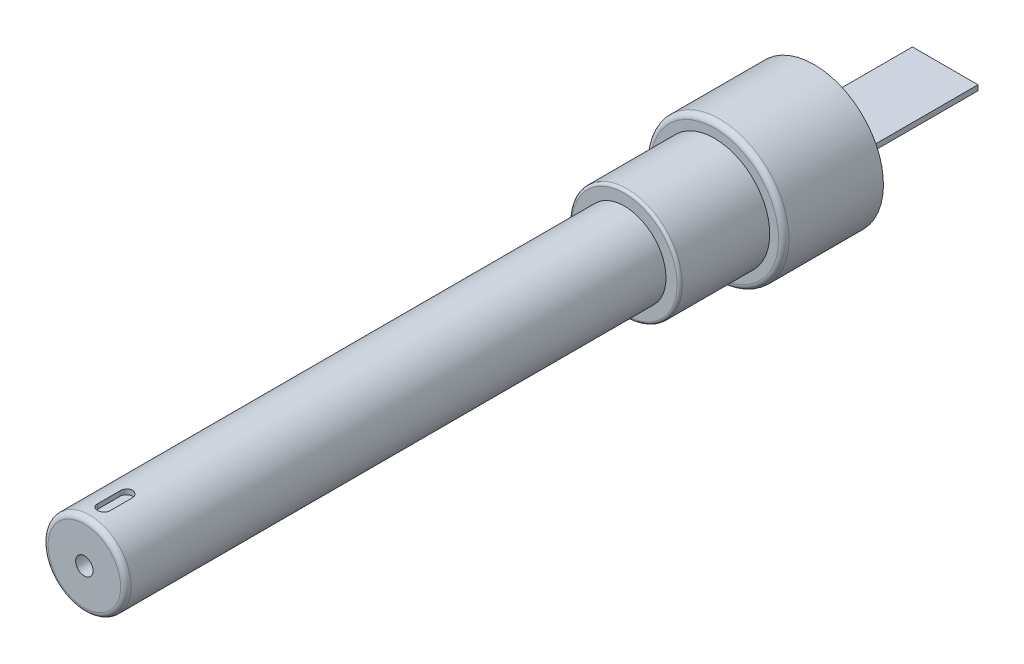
ISO-10303-21;
HEADER;
FILE_DESCRIPTION(('STEP AP214'),'2;1');
FILE_NAME('part.step','',(''),(''),'','','');
FILE_SCHEMA(('AUTOMOTIVE_DESIGN { 1 0 10303 214 1 1 1 1 }'));
ENDSEC;
DATA;
#1=APPLICATION_CONTEXT('core data for automotive mechanical design processes');
#2=APPLICATION_PROTOCOL_DEFINITION('international standard','automotive_design',2000,#1);
#3=PRODUCT_CONTEXT('',#1,'mechanical');
#4=PRODUCT('Part','Part','',(#3));
#5=PRODUCT_RELATED_PRODUCT_CATEGORY('part','',(#4));
#6=PRODUCT_DEFINITION_FORMATION('','',#4);
#7=PRODUCT_DEFINITION_CONTEXT('part definition',#1,'design');
#8=PRODUCT_DEFINITION('design','',#6,#7);
#9=PRODUCT_DEFINITION_SHAPE('','',#8);
#10=(LENGTH_UNIT() NAMED_UNIT(*) SI_UNIT(.MILLI.,.METRE.));
#11=(NAMED_UNIT(*) PLANE_ANGLE_UNIT() SI_UNIT($,.RADIAN.));
#12=(NAMED_UNIT(*) SI_UNIT($,.STERADIAN.) SOLID_ANGLE_UNIT());
#13=UNCERTAINTY_MEASURE_WITH_UNIT(LENGTH_MEASURE(1.E-05),#10,'distance_accuracy_value','');
#14=(GEOMETRIC_REPRESENTATION_CONTEXT(3) GLOBAL_UNCERTAINTY_ASSIGNED_CONTEXT((#13)) GLOBAL_UNIT_ASSIGNED_CONTEXT((#10,
#11,#12)) REPRESENTATION_CONTEXT('',''));
#15=CARTESIAN_POINT('',(0.,0.,0.));
#16=DIRECTION('',(0.,0.,1.));
#17=DIRECTION('',(1.,0.,0.));
#18=AXIS2_PLACEMENT_3D('',#15,#16,#17);
#19=CARTESIAN_POINT('',(0.,8.8011,-99.695));
#20=DIRECTION('',(0.,0.,-1.));
#21=DIRECTION('',(0.,1.,0.));
#22=AXIS2_PLACEMENT_3D('',#19,#20,#21);
#23=PLANE('',#22);
#24=CARTESIAN_POINT('',(0.,0.,-99.695));
#25=DIRECTION('',(0.,0.,-1.));
#26=DIRECTION('',(0.,1.,0.));
#27=AXIS2_PLACEMENT_3D('',#24,#25,#26);
#28=CIRCLE('',#27,8.8011);
#29=CARTESIAN_POINT('',(0.,8.8011,-99.695));
#30=VERTEX_POINT('',#29);
#31=EDGE_CURVE('E153',#30,#30,#28,.T.);
#32=ORIENTED_EDGE('',*,*,#31,.T.);
#33=EDGE_LOOP('',(#32));
#34=FACE_BOUND('',#33,.T.);
#35=DIRECTION('',(-1.,0.,0.));
#36=VECTOR('',#35,1.);
#37=CARTESIAN_POINT('',(4.7625,-0.380999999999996,-99.695));
#38=LINE('',#37,#36);
#39=CARTESIAN_POINT('',(4.7625,-0.380999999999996,-99.695));
#40=VERTEX_POINT('',#39);
#41=CARTESIAN_POINT('',(-4.7625,-0.380999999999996,-99.695));
#42=VERTEX_POINT('',#41);
#43=EDGE_CURVE('E439',#40,#42,#38,.T.);
#44=ORIENTED_EDGE('',*,*,#43,.F.);
#45=DIRECTION('',(0.,-1.,0.));
#46=VECTOR('',#45,1.);
#47=CARTESIAN_POINT('',(4.7625,0.381000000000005,-99.695));
#48=LINE('',#47,#46);
#49=CARTESIAN_POINT('',(4.7625,0.381000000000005,-99.695));
#50=VERTEX_POINT('',#49);
#51=EDGE_CURVE('E126',#50,#40,#48,.T.);
#52=ORIENTED_EDGE('',*,*,#51,.F.);
#53=DIRECTION('',(1.,0.,0.));
#54=VECTOR('',#53,1.);
#55=CARTESIAN_POINT('',(4.7625,0.381000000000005,-99.695));
#56=LINE('',#55,#54);
#57=CARTESIAN_POINT('',(-4.7625,0.381000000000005,-99.695));
#58=VERTEX_POINT('',#57);
#59=EDGE_CURVE('E122',#58,#50,#56,.T.);
#60=ORIENTED_EDGE('',*,*,#59,.F.);
#61=DIRECTION('',(0.,1.,0.));
#62=VECTOR('',#61,1.);
#63=CARTESIAN_POINT('',(-4.7625,0.381000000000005,-99.695));
#64=LINE('',#63,#62);
#65=EDGE_CURVE('E436',#42,#58,#64,.T.);
#66=ORIENTED_EDGE('',*,*,#65,.F.);
#67=EDGE_LOOP('',(#44,#52,#60,#66));
#68=FACE_BOUND('',#67,.T.);
#69=ADVANCED_FACE('F36',(#34,#68),#23,.T.);
#70=CARTESIAN_POINT('',(0.,0.,0.));
#71=DIRECTION('',(0.,0.,1.));
#72=DIRECTION('',(1.,0.,0.));
#73=AXIS2_PLACEMENT_3D('',#70,#71,#72);
#74=CYLINDRICAL_SURFACE('',#73,6.0325);
#75=DIRECTION('',(0.,0.,1.));
#76=VECTOR('',#75,1.);
#77=CARTESIAN_POINT('',(-0.888999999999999,5.96663516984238,0.));
#78=LINE('',#77,#76);
#79=CARTESIAN_POINT('',(-0.889,5.96663516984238,-2.794));
#80=VERTEX_POINT('',#79);
#81=CARTESIAN_POINT('',(-0.889000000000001,5.96663516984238,-6.096));
#82=VERTEX_POINT('',#81);
#83=EDGE_CURVE('E11',#80,#82,#78,.F.);
#84=ORIENTED_EDGE('',*,*,#83,.T.);
#85=CARTESIAN_POINT('',(-0.889000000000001,5.96663516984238,-6.096));
#86=CARTESIAN_POINT('',(-0.889043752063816,5.96661094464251,-6.14572551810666));
#87=CARTESIAN_POINT('',(-0.884830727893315,5.96725612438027,-6.19543217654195));
#88=CARTESIAN_POINT('',(-0.868221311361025,5.96970468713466,-6.29337180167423));
#89=CARTESIAN_POINT('',(-0.855834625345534,5.97150669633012,-6.34160644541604));
#90=CARTESIAN_POINT('',(-0.823202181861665,5.97608973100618,-6.43530329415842));
#91=CARTESIAN_POINT('',(-0.802954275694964,5.97887102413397,-6.48076473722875));
#92=CARTESIAN_POINT('',(-0.755200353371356,5.98509066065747,-6.56764530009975));
#93=CARTESIAN_POINT('',(-0.727694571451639,5.98852898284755,-6.60906455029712));
#94=CARTESIAN_POINT('',(-0.665978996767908,5.99570645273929,-6.68699980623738));
#95=CARTESIAN_POINT('',(-0.631724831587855,5.99944748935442,-6.72348050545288));
#96=CARTESIAN_POINT('',(-0.557577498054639,6.00679192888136,-6.7902017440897));
#97=CARTESIAN_POINT('',(-0.517683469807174,6.01039531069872,-6.82044133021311));
#98=CARTESIAN_POINT('',(-0.433162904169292,6.01707808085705,-6.87394850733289));
#99=CARTESIAN_POINT('',(-0.388515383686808,6.02015497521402,-6.89718329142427));
#100=CARTESIAN_POINT('',(-0.295901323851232,6.02541677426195,-6.93580963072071));
#101=CARTESIAN_POINT('',(-0.247935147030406,6.02760177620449,-6.95120204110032));
#102=CARTESIAN_POINT('',(-0.150410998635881,6.03082040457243,-6.97360045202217));
#103=CARTESIAN_POINT('',(-0.100867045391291,6.03186224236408,-6.98066628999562));
#104=CARTESIAN_POINT('',(-0.00128529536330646,6.03270529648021,-6.986396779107));
#105=CARTESIAN_POINT('',(0.048752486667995,6.03250654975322,-6.98506168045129));
#106=CARTESIAN_POINT('',(0.147490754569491,6.03089735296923,-6.97407519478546));
#107=CARTESIAN_POINT('',(0.196198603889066,6.02949631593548,-6.96448841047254));
#108=CARTESIAN_POINT('',(0.291306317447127,6.0256504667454,-6.93737209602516));
#109=CARTESIAN_POINT('',(0.337706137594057,6.02320563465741,-6.91984241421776));
#110=CARTESIAN_POINT('',(0.42707782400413,6.01753066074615,-6.87727114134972));
#111=CARTESIAN_POINT('',(0.470036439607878,6.01429766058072,-6.85220212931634));
#112=CARTESIAN_POINT('',(0.551159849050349,6.00740700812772,-6.79528477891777));
#113=CARTESIAN_POINT('',(0.589324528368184,6.00374934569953,-6.7634362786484));
#114=CARTESIAN_POINT('',(0.660154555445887,5.99637678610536,-6.6935088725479));
#115=CARTESIAN_POINT('',(0.692765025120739,5.99266167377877,-6.65537438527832));
#116=CARTESIAN_POINT('',(0.751141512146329,5.98562530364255,-6.57413123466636));
#117=CARTESIAN_POINT('',(0.776905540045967,5.98230416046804,-6.53102113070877));
#118=CARTESIAN_POINT('',(0.820864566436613,5.97643137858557,-6.44098828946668));
#119=CARTESIAN_POINT('',(0.839049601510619,5.97388075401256,-6.394060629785));
#120=CARTESIAN_POINT('',(0.86723848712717,5.96985425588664,-6.29780433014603));
#121=CARTESIAN_POINT('',(0.877254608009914,5.96837677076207,-6.24847940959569));
#122=CARTESIAN_POINT('',(0.885031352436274,5.96722528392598,-6.18165777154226));
#123=CARTESIAN_POINT('',(0.886520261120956,5.96700416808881,-6.1645456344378));
#124=CARTESIAN_POINT('',(0.888503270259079,5.96670927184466,-6.1302914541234));
#125=CARTESIAN_POINT('',(0.888999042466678,5.96663524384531,-6.11314950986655));
#126=CARTESIAN_POINT('',(0.889,5.96663516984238,-6.096));
#127=B_SPLINE_CURVE_WITH_KNOTS('',3,(#85,#86,#87,#88,#89,#90,#91,#92,#93,#94,#95,#96,#97,#98,
#99,#100,#101,#102,#103,#104,#105,#106,#107,#108,#109,#110,#111,#112,#113,#114,#115,#116,#117,
#118,#119,#120,#121,#122,#123,#124,#125,#126),.UNSPECIFIED.,.F.,.F.,(4,2,2,2,2,2,2,2,2,2,2,2,2,
2,2,2,2,2,2,2,4),(0.,0.148966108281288,0.297755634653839,0.446585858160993,0.59541127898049,
0.745250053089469,0.895111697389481,1.04566468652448,1.19620125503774,1.34564929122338,
1.49509287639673,1.64337699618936,1.79166394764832,1.94049688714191,2.08933338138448,
2.23956444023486,2.38983910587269,2.54031070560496,2.6905558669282,2.74206874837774,
2.79349484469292),.UNSPECIFIED.);
#128=CARTESIAN_POINT('',(0.888999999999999,5.96663516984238,-6.096));
#129=VERTEX_POINT('',#128);
#130=EDGE_CURVE('E199',#82,#129,#127,.T.);
#131=ORIENTED_EDGE('',*,*,#130,.T.);
#132=DIRECTION('',(0.,0.,1.));
#133=VECTOR('',#132,1.);
#134=CARTESIAN_POINT('',(0.889,5.96663516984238,0.));
#135=LINE('',#134,#133);
#136=CARTESIAN_POINT('',(0.889,5.96663516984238,-2.794));
#137=VERTEX_POINT('',#136);
#138=EDGE_CURVE('E45',#129,#137,#135,.T.);
#139=ORIENTED_EDGE('',*,*,#138,.T.);
#140=CARTESIAN_POINT('',(0.889,5.96663516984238,-2.794));
#141=CARTESIAN_POINT('',(0.889043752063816,5.96661094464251,-2.74427448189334));
#142=CARTESIAN_POINT('',(0.884830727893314,5.96725612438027,-2.69456782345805));
#143=CARTESIAN_POINT('',(0.868221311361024,5.96970468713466,-2.59662819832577));
#144=CARTESIAN_POINT('',(0.855834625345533,5.97150669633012,-2.54839355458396));
#145=CARTESIAN_POINT('',(0.823202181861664,5.97608973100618,-2.45469670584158));
#146=CARTESIAN_POINT('',(0.802954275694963,5.97887102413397,-2.40923526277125));
#147=CARTESIAN_POINT('',(0.755200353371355,5.98509066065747,-2.32235469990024));
#148=CARTESIAN_POINT('',(0.727694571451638,5.98852898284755,-2.28093544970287));
#149=CARTESIAN_POINT('',(0.665978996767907,5.99570645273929,-2.20300019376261));
#150=CARTESIAN_POINT('',(0.631724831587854,5.99944748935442,-2.16651949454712));
#151=CARTESIAN_POINT('',(0.557577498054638,6.00679192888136,-2.0997982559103));
#152=CARTESIAN_POINT('',(0.517683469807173,6.01039531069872,-2.06955866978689));
#153=CARTESIAN_POINT('',(0.433162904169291,6.01707808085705,-2.0160514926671));
#154=CARTESIAN_POINT('',(0.388515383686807,6.02015497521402,-1.99281670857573));
#155=CARTESIAN_POINT('',(0.295901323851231,6.02541677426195,-1.95419036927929));
#156=CARTESIAN_POINT('',(0.247935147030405,6.02760177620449,-1.93879795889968));
#157=CARTESIAN_POINT('',(0.15041099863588,6.03082040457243,-1.91639954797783));
#158=CARTESIAN_POINT('',(0.10086704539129,6.03186224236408,-1.90933371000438));
#159=CARTESIAN_POINT('',(0.0012852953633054,6.03270529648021,-1.903603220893));
#160=CARTESIAN_POINT('',(-0.0487524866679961,6.03250654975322,-1.90493831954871));
#161=CARTESIAN_POINT('',(-0.147490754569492,6.03089735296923,-1.91592480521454));
#162=CARTESIAN_POINT('',(-0.196198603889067,6.02949631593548,-1.92551158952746));
#163=CARTESIAN_POINT('',(-0.291306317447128,6.0256504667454,-1.95262790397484));
#164=CARTESIAN_POINT('',(-0.337706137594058,6.02320563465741,-1.97015758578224));
#165=CARTESIAN_POINT('',(-0.427077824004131,6.01753066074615,-2.01272885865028));
#166=CARTESIAN_POINT('',(-0.470036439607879,6.01429766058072,-2.03779787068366));
#167=CARTESIAN_POINT('',(-0.55115984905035,6.00740700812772,-2.09471522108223));
#168=CARTESIAN_POINT('',(-0.589324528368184,6.00374934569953,-2.1265637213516));
#169=CARTESIAN_POINT('',(-0.660154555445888,5.99637678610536,-2.1964911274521));
#170=CARTESIAN_POINT('',(-0.69276502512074,5.99266167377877,-2.23462561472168));
#171=CARTESIAN_POINT('',(-0.75114151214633,5.98562530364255,-2.31586876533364));
#172=CARTESIAN_POINT('',(-0.776905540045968,5.98230416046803,-2.35897886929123));
#173=CARTESIAN_POINT('',(-0.820864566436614,5.97643137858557,-2.44901171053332));
#174=CARTESIAN_POINT('',(-0.83904960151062,5.97388075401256,-2.495939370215));
#175=CARTESIAN_POINT('',(-0.867238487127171,5.96985425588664,-2.59219566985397));
#176=CARTESIAN_POINT('',(-0.877254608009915,5.96837677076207,-2.64152059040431));
#177=CARTESIAN_POINT('',(-0.885031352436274,5.96722528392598,-2.70834222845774));
#178=CARTESIAN_POINT('',(-0.886520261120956,5.96700416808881,-2.7254543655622));
#179=CARTESIAN_POINT('',(-0.888503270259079,5.96670927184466,-2.7597085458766));
#180=CARTESIAN_POINT('',(-0.888999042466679,5.96663524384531,-2.77685049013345));
#181=CARTESIAN_POINT('',(-0.889,5.96663516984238,-2.794));
#182=B_SPLINE_CURVE_WITH_KNOTS('',3,(#140,#141,#142,#143,#144,#145,#146,#147,#148,#149,#150,
#151,#152,#153,#154,#155,#156,#157,#158,#159,#160,#161,#162,#163,#164,#165,#166,#167,#168,#169,
#170,#171,#172,#173,#174,#175,#176,#177,#178,#179,#180,#181),.UNSPECIFIED.,.F.,.F.,(4,2,2,2,2,2,
2,2,2,2,2,2,2,2,2,2,2,2,2,2,4),(0.,0.148966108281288,0.297755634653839,0.446585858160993,
0.595411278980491,0.745250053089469,0.895111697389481,1.04566468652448,1.19620125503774,
1.34564929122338,1.49509287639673,1.64337699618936,1.79166394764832,1.94049688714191,
2.08933338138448,2.23956444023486,2.38983910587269,2.54031070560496,2.6905558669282,
2.74206874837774,2.79349484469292),.UNSPECIFIED.);
#183=EDGE_CURVE('E60',#137,#80,#182,.T.);
#184=ORIENTED_EDGE('',*,*,#183,.T.);
#185=EDGE_LOOP('',(#84,#131,#139,#184));
#186=FACE_BOUND('',#185,.T.);
#187=CARTESIAN_POINT('',(0.,0.,-0.762000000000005));
#188=DIRECTION('',(0.,0.,1.));
#189=DIRECTION('',(1.,0.,0.));
#190=AXIS2_PLACEMENT_3D('',#187,#188,#189);
#191=CIRCLE('',#190,6.0325);
#192=CARTESIAN_POINT('',(6.0325,0.,-0.762000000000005));
#193=VERTEX_POINT('',#192);
#194=EDGE_CURVE('E196',#193,#193,#191,.T.);
#195=ORIENTED_EDGE('',*,*,#194,.F.);
#196=EDGE_LOOP('',(#195));
#197=FACE_BOUND('',#196,.T.);
#198=CARTESIAN_POINT('',(0.,0.,-78.486));
#199=DIRECTION('',(0.,0.,1.));
#200=DIRECTION('',(0.,-1.,0.));
#201=AXIS2_PLACEMENT_3D('',#198,#199,#200);
#202=CIRCLE('',#201,6.0325);
#203=CARTESIAN_POINT('',(0.,-6.0325,-78.486));
#204=VERTEX_POINT('',#203);
#205=EDGE_CURVE('E156',#204,#204,#202,.T.);
#206=ORIENTED_EDGE('',*,*,#205,.T.);
#207=EDGE_LOOP('',(#206));
#208=FACE_BOUND('',#207,.T.);
#209=ADVANCED_FACE('F38',(#186,#197,#208),#74,.T.);
#210=CARTESIAN_POINT('',(0.,0.,-0.762));
#211=DIRECTION('',(0.,0.,1.));
#212=DIRECTION('',(1.,0.,0.));
#213=AXIS2_PLACEMENT_3D('',#210,#211,#212);
#214=TOROIDAL_SURFACE('',#213,5.2705,0.762);
#215=CARTESIAN_POINT('',(0.,0.,0.));
#216=DIRECTION('',(0.,0.,1.));
#217=DIRECTION('',(1.,0.,0.));
#218=AXIS2_PLACEMENT_3D('',#215,#216,#217);
#219=CIRCLE('',#218,5.27049999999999);
#220=CARTESIAN_POINT('',(5.27049999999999,0.,0.));
#221=VERTEX_POINT('',#220);
#222=EDGE_CURVE('E193',#221,#221,#219,.T.);
#223=ORIENTED_EDGE('',*,*,#222,.F.);
#224=EDGE_LOOP('',(#223));
#225=FACE_BOUND('',#224,.T.);
#226=ORIENTED_EDGE('',*,*,#194,.T.);
#227=EDGE_LOOP('',(#226));
#228=FACE_BOUND('',#227,.T.);
#229=ADVANCED_FACE('F242',(#225,#228),#214,.T.);
#230=CARTESIAN_POINT('',(0.,1.27,0.));
#231=DIRECTION('',(0.,0.,-1.));
#232=DIRECTION('',(-1.,0.,0.));
#233=AXIS2_PLACEMENT_3D('',#230,#231,#232);
#234=PLANE('',#233);
#235=CARTESIAN_POINT('',(0.,0.,0.));
#236=DIRECTION('',(0.,0.,1.));
#237=DIRECTION('',(1.,0.,0.));
#238=AXIS2_PLACEMENT_3D('',#235,#236,#237);
#239=CIRCLE('',#238,1.27);
#240=CARTESIAN_POINT('',(1.27,0.,0.));
#241=VERTEX_POINT('',#240);
#242=EDGE_CURVE('E190',#241,#241,#239,.T.);
#243=ORIENTED_EDGE('',*,*,#242,.F.);
#244=EDGE_LOOP('',(#243));
#245=FACE_BOUND('',#244,.T.);
#246=ORIENTED_EDGE('',*,*,#222,.T.);
#247=EDGE_LOOP('',(#246));
#248=FACE_BOUND('',#247,.T.);
#249=ADVANCED_FACE('F239',(#245,#248),#234,.F.);
#250=CARTESIAN_POINT('',(0.,0.,0.));
#251=DIRECTION('',(0.,0.,1.));
#252=DIRECTION('',(1.,0.,0.));
#253=AXIS2_PLACEMENT_3D('',#250,#251,#252);
#254=CYLINDRICAL_SURFACE('',#253,1.27);
#255=CARTESIAN_POINT('',(0.,0.,-9.525));
#256=DIRECTION('',(0.,0.,1.));
#257=DIRECTION('',(1.,0.,0.));
#258=AXIS2_PLACEMENT_3D('',#255,#256,#257);
#259=CIRCLE('',#258,1.27);
#260=CARTESIAN_POINT('',(1.27,0.,-9.525));
#261=VERTEX_POINT('',#260);
#262=EDGE_CURVE('E187',#261,#261,#259,.T.);
#263=ORIENTED_EDGE('',*,*,#262,.F.);
#264=EDGE_LOOP('',(#263));
#265=FACE_BOUND('',#264,.T.);
#266=ORIENTED_EDGE('',*,*,#242,.T.);
#267=EDGE_LOOP('',(#266));
#268=FACE_BOUND('',#267,.T.);
#269=ADVANCED_FACE('F235',(#265,#268),#254,.F.);
#270=CARTESIAN_POINT('',(0.,5.5245,-9.525));
#271=DIRECTION('',(0.,0.,1.));
#272=DIRECTION('',(1.,0.,0.));
#273=AXIS2_PLACEMENT_3D('',#270,#271,#272);
#274=PLANE('',#273);
#275=CARTESIAN_POINT('',(0.,0.,-9.525));
#276=DIRECTION('',(0.,0.,1.));
#277=DIRECTION('',(1.,0.,0.));
#278=AXIS2_PLACEMENT_3D('',#275,#276,#277);
#279=CIRCLE('',#278,5.5245);
#280=CARTESIAN_POINT('',(5.5245,0.,-9.525));
#281=VERTEX_POINT('',#280);
#282=EDGE_CURVE('E184',#281,#281,#279,.T.);
#283=ORIENTED_EDGE('',*,*,#282,.F.);
#284=EDGE_LOOP('',(#283));
#285=FACE_BOUND('',#284,.T.);
#286=ORIENTED_EDGE('',*,*,#262,.T.);
#287=EDGE_LOOP('',(#286));
#288=FACE_BOUND('',#287,.T.);
#289=ADVANCED_FACE('F231',(#285,#288),#274,.F.);
#290=CARTESIAN_POINT('',(0.,0.,0.));
#291=DIRECTION('',(0.,0.,1.));
#292=DIRECTION('',(1.,0.,0.));
#293=AXIS2_PLACEMENT_3D('',#290,#291,#292);
#294=CYLINDRICAL_SURFACE('',#293,5.5245);
#295=CARTESIAN_POINT('',(0.,0.,-78.486));
#296=DIRECTION('',(0.,0.,1.));
#297=DIRECTION('',(1.,0.,0.));
#298=AXIS2_PLACEMENT_3D('',#295,#296,#297);
#299=CIRCLE('',#298,5.5245);
#300=CARTESIAN_POINT('',(5.5245,0.,-78.486));
#301=VERTEX_POINT('',#300);
#302=EDGE_CURVE('E174',#301,#301,#299,.T.);
#303=ORIENTED_EDGE('',*,*,#302,.F.);
#304=EDGE_LOOP('',(#303));
#305=FACE_BOUND('',#304,.T.);
#306=ORIENTED_EDGE('',*,*,#282,.T.);
#307=EDGE_LOOP('',(#306));
#308=FACE_BOUND('',#307,.T.);
#309=ADVANCED_FACE('F228',(#305,#308),#294,.F.);
#310=CARTESIAN_POINT('',(0.,5.2705,-2.794));
#311=DIRECTION('',(0.,1.,0.));
#312=DIRECTION('',(0.,0.,1.));
#313=AXIS2_PLACEMENT_3D('',#310,#311,#312);
#314=CYLINDRICAL_SURFACE('',#313,0.889);
#315=DIRECTION('',(0.,1.,0.));
#316=VECTOR('',#315,1.);
#317=CARTESIAN_POINT('',(0.889,5.2705,-2.794));
#318=LINE('',#317,#316);
#319=CARTESIAN_POINT('',(0.889,5.2705,-2.794));
#320=VERTEX_POINT('',#319);
#321=EDGE_CURVE('E171',#320,#137,#318,.T.);
#322=ORIENTED_EDGE('',*,*,#321,.F.);
#323=CARTESIAN_POINT('',(0.,5.2705,-2.794));
#324=DIRECTION('',(0.,1.,0.));
#325=DIRECTION('',(0.,0.,1.));
#326=AXIS2_PLACEMENT_3D('',#323,#324,#325);
#327=CIRCLE('',#326,0.889);
#328=CARTESIAN_POINT('',(-0.889,5.2705,-2.794));
#329=VERTEX_POINT('',#328);
#330=EDGE_CURVE('E159',#329,#320,#327,.T.);
#331=ORIENTED_EDGE('',*,*,#330,.F.);
#332=DIRECTION('',(0.,1.,0.));
#333=VECTOR('',#332,1.);
#334=CARTESIAN_POINT('',(-0.889,5.2705,-2.794));
#335=LINE('',#334,#333);
#336=EDGE_CURVE('E172',#329,#80,#335,.T.);
#337=ORIENTED_EDGE('',*,*,#336,.T.);
#338=ORIENTED_EDGE('',*,*,#183,.F.);
#339=EDGE_LOOP('',(#322,#331,#337,#338));
#340=FACE_BOUND('',#339,.T.);
#341=ADVANCED_FACE('F224',(#340),#314,.F.);
#342=CARTESIAN_POINT('',(-0.889,5.2705,-2.794));
#343=DIRECTION('',(-1.,0.,0.));
#344=DIRECTION('',(0.,0.,1.));
#345=AXIS2_PLACEMENT_3D('',#342,#343,#344);
#346=PLANE('',#345);
#347=ORIENTED_EDGE('',*,*,#336,.F.);
#348=DIRECTION('',(0.,0.,1.));
#349=VECTOR('',#348,1.);
#350=CARTESIAN_POINT('',(-0.889,5.2705,-2.794));
#351=LINE('',#350,#349);
#352=CARTESIAN_POINT('',(-0.889000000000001,5.2705,-6.096));
#353=VERTEX_POINT('',#352);
#354=EDGE_CURVE('E168',#353,#329,#351,.T.);
#355=ORIENTED_EDGE('',*,*,#354,.F.);
#356=DIRECTION('',(0.,1.,0.));
#357=VECTOR('',#356,1.);
#358=CARTESIAN_POINT('',(-0.889000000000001,5.2705,-6.096));
#359=LINE('',#358,#357);
#360=EDGE_CURVE('E175',#353,#82,#359,.T.);
#361=ORIENTED_EDGE('',*,*,#360,.T.);
#362=ORIENTED_EDGE('',*,*,#83,.F.);
#363=EDGE_LOOP('',(#347,#355,#361,#362));
#364=FACE_BOUND('',#363,.T.);
#365=ADVANCED_FACE('F218',(#364),#346,.F.);
#366=CARTESIAN_POINT('',(0.,5.2705,-6.096));
#367=DIRECTION('',(0.,1.,0.));
#368=DIRECTION('',(0.,0.,1.));
#369=AXIS2_PLACEMENT_3D('',#366,#367,#368);
#370=CYLINDRICAL_SURFACE('',#369,0.889);
#371=ORIENTED_EDGE('',*,*,#360,.F.);
#372=CARTESIAN_POINT('',(0.,5.2705,-6.096));
#373=DIRECTION('',(0.,1.,0.));
#374=DIRECTION('',(0.,0.,1.));
#375=AXIS2_PLACEMENT_3D('',#372,#373,#374);
#376=CIRCLE('',#375,0.889);
#377=CARTESIAN_POINT('',(0.888999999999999,5.2705,-6.096));
#378=VERTEX_POINT('',#377);
#379=EDGE_CURVE('E165',#378,#353,#376,.T.);
#380=ORIENTED_EDGE('',*,*,#379,.F.);
#381=DIRECTION('',(0.,1.,0.));
#382=VECTOR('',#381,1.);
#383=CARTESIAN_POINT('',(0.888999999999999,5.2705,-6.096));
#384=LINE('',#383,#382);
#385=EDGE_CURVE('E178',#378,#129,#384,.T.);
#386=ORIENTED_EDGE('',*,*,#385,.T.);
#387=ORIENTED_EDGE('',*,*,#130,.F.);
#388=EDGE_LOOP('',(#371,#380,#386,#387));
#389=FACE_BOUND('',#388,.T.);
#390=ADVANCED_FACE('F212',(#389),#370,.F.);
#391=CARTESIAN_POINT('',(0.889,5.2705,-2.794));
#392=DIRECTION('',(1.,0.,0.));
#393=DIRECTION('',(0.,0.,-1.));
#394=AXIS2_PLACEMENT_3D('',#391,#392,#393);
#395=PLANE('',#394);
#396=ORIENTED_EDGE('',*,*,#385,.F.);
#397=DIRECTION('',(0.,0.,-1.));
#398=VECTOR('',#397,1.);
#399=CARTESIAN_POINT('',(0.889,5.2705,-2.794));
#400=LINE('',#399,#398);
#401=EDGE_CURVE('E162',#320,#378,#400,.T.);
#402=ORIENTED_EDGE('',*,*,#401,.F.);
#403=ORIENTED_EDGE('',*,*,#321,.T.);
#404=ORIENTED_EDGE('',*,*,#138,.F.);
#405=EDGE_LOOP('',(#396,#402,#403,#404));
#406=FACE_BOUND('',#405,.T.);
#407=ADVANCED_FACE('F217',(#406),#395,.F.);
#408=CARTESIAN_POINT('',(0.,5.2705,-2.794));
#409=DIRECTION('',(0.,1.,0.));
#410=DIRECTION('',(0.,0.,1.));
#411=AXIS2_PLACEMENT_3D('',#408,#409,#410);
#412=PLANE('',#411);
#413=ORIENTED_EDGE('',*,*,#330,.T.);
#414=ORIENTED_EDGE('',*,*,#401,.T.);
#415=ORIENTED_EDGE('',*,*,#379,.T.);
#416=ORIENTED_EDGE('',*,*,#354,.T.);
#417=EDGE_LOOP('',(#413,#414,#415,#416));
#418=FACE_BOUND('',#417,.T.);
#419=ADVANCED_FACE('F222',(#418),#412,.T.);
#420=CARTESIAN_POINT('',(0.,0.,-78.486));
#421=DIRECTION('',(0.,0.,1.));
#422=DIRECTION('',(0.,-1.,0.));
#423=AXIS2_PLACEMENT_3D('',#420,#421,#422);
#424=PLANE('',#423);
#425=ORIENTED_EDGE('',*,*,#302,.T.);
#426=EDGE_LOOP('',(#425));
#427=FACE_BOUND('',#426,.T.);
#428=ADVANCED_FACE('F264',(#427),#424,.T.);
#429=CARTESIAN_POINT('',(0.,0.,-78.486));
#430=DIRECTION('',(0.,0.,-1.));
#431=DIRECTION('',(0.,1.,0.));
#432=AXIS2_PLACEMENT_3D('',#429,#430,#431);
#433=CIRCLE('',#432,7.6454);
#434=CARTESIAN_POINT('',(0.,7.6454,-78.486));
#435=VERTEX_POINT('',#434);
#436=EDGE_CURVE('E128',#435,#435,#433,.T.);
#437=ORIENTED_EDGE('',*,*,#436,.F.);
#438=EDGE_LOOP('',(#437));
#439=FACE_BOUND('',#438,.T.);
#440=ORIENTED_EDGE('',*,*,#205,.F.);
#441=EDGE_LOOP('',(#440));
#442=FACE_BOUND('',#441,.T.);
#443=ADVANCED_FACE('F262',(#439,#442),#424,.T.);
#444=CARTESIAN_POINT('',(0.,0.,-116.808391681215));
#445=DIRECTION('',(0.,0.,-1.));
#446=DIRECTION('',(0.,1.,0.));
#447=AXIS2_PLACEMENT_3D('',#444,#445,#446);
#448=CYLINDRICAL_SURFACE('',#447,8.8011);
#449=CARTESIAN_POINT('',(0.,0.,-106.045));
#450=DIRECTION('',(0.,0.,-1.));
#451=DIRECTION('',(0.,1.,0.));
#452=AXIS2_PLACEMENT_3D('',#449,#450,#451);
#453=CIRCLE('',#452,8.8011);
#454=CARTESIAN_POINT('',(0.,8.8011,-106.045));
#455=VERTEX_POINT('',#454);
#456=EDGE_CURVE('E150',#455,#455,#453,.T.);
#457=ORIENTED_EDGE('',*,*,#456,.T.);
#458=EDGE_LOOP('',(#457));
#459=FACE_BOUND('',#458,.T.);
#460=ORIENTED_EDGE('',*,*,#31,.F.);
#461=EDGE_LOOP('',(#460));
#462=FACE_BOUND('',#461,.T.);
#463=ADVANCED_FACE('F260',(#459,#462),#448,.F.);
#464=CARTESIAN_POINT('',(0.,10.0711,-106.045));
#465=DIRECTION('',(0.,0.,-1.));
#466=DIRECTION('',(0.,1.,0.));
#467=AXIS2_PLACEMENT_3D('',#464,#465,#466);
#468=PLANE('',#467);
#469=CARTESIAN_POINT('',(0.,0.,-106.045));
#470=DIRECTION('',(0.,0.,-1.));
#471=DIRECTION('',(0.,1.,0.));
#472=AXIS2_PLACEMENT_3D('',#469,#470,#471);
#473=CIRCLE('',#472,10.0711);
#474=CARTESIAN_POINT('',(0.,10.0711,-106.045));
#475=VERTEX_POINT('',#474);
#476=EDGE_CURVE('E147',#475,#475,#473,.T.);
#477=ORIENTED_EDGE('',*,*,#476,.T.);
#478=EDGE_LOOP('',(#477));
#479=FACE_BOUND('',#478,.T.);
#480=ORIENTED_EDGE('',*,*,#456,.F.);
#481=EDGE_LOOP('',(#480));
#482=FACE_BOUND('',#481,.T.);
#483=ADVANCED_FACE('F324',(#479,#482),#468,.T.);
#484=CARTESIAN_POINT('',(0.,0.,-116.808391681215));
#485=DIRECTION('',(0.,0.,-1.));
#486=DIRECTION('',(0.,1.,0.));
#487=AXIS2_PLACEMENT_3D('',#484,#485,#486);
#488=CYLINDRICAL_SURFACE('',#487,10.0711);
#489=CARTESIAN_POINT('',(0.,0.,-92.329));
#490=DIRECTION('',(0.,0.,-1.));
#491=DIRECTION('',(0.,1.,0.));
#492=AXIS2_PLACEMENT_3D('',#489,#490,#491);
#493=CIRCLE('',#492,10.0711);
#494=CARTESIAN_POINT('',(0.,10.0711,-92.329));
#495=VERTEX_POINT('',#494);
#496=EDGE_CURVE('E144',#495,#495,#493,.T.);
#497=ORIENTED_EDGE('',*,*,#496,.T.);
#498=EDGE_LOOP('',(#497));
#499=FACE_BOUND('',#498,.T.);
#500=ORIENTED_EDGE('',*,*,#476,.F.);
#501=EDGE_LOOP('',(#500));
#502=FACE_BOUND('',#501,.T.);
#503=ADVANCED_FACE('F333',(#499,#502),#488,.T.);
#504=CARTESIAN_POINT('',(0.,0.,-92.329));
#505=DIRECTION('',(0.,0.,-1.));
#506=DIRECTION('',(0.,1.,0.));
#507=AXIS2_PLACEMENT_3D('',#504,#505,#506);
#508=TOROIDAL_SURFACE('',#507,9.3091,0.762);
#509=CARTESIAN_POINT('',(0.,0.,-91.567));
#510=DIRECTION('',(0.,0.,-1.));
#511=DIRECTION('',(0.,1.,0.));
#512=AXIS2_PLACEMENT_3D('',#509,#510,#511);
#513=CIRCLE('',#512,9.3091);
#514=CARTESIAN_POINT('',(0.,9.3091,-91.567));
#515=VERTEX_POINT('',#514);
#516=EDGE_CURVE('E141',#515,#515,#513,.T.);
#517=ORIENTED_EDGE('',*,*,#516,.T.);
#518=EDGE_LOOP('',(#517));
#519=FACE_BOUND('',#518,.T.);
#520=ORIENTED_EDGE('',*,*,#496,.F.);
#521=EDGE_LOOP('',(#520));
#522=FACE_BOUND('',#521,.T.);
#523=ADVANCED_FACE('F342',(#519,#522),#508,.T.);
#524=CARTESIAN_POINT('',(0.,8.0264,-91.567));
#525=DIRECTION('',(0.,0.,1.));
#526=DIRECTION('',(0.,-1.,0.));
#527=AXIS2_PLACEMENT_3D('',#524,#525,#526);
#528=PLANE('',#527);
#529=CARTESIAN_POINT('',(0.,0.,-91.567));
#530=DIRECTION('',(0.,0.,-1.));
#531=DIRECTION('',(0.,1.,0.));
#532=AXIS2_PLACEMENT_3D('',#529,#530,#531);
#533=CIRCLE('',#532,8.0264);
#534=CARTESIAN_POINT('',(0.,8.0264,-91.567));
#535=VERTEX_POINT('',#534);
#536=EDGE_CURVE('E138',#535,#535,#533,.T.);
#537=ORIENTED_EDGE('',*,*,#536,.T.);
#538=EDGE_LOOP('',(#537));
#539=FACE_BOUND('',#538,.T.);
#540=ORIENTED_EDGE('',*,*,#516,.F.);
#541=EDGE_LOOP('',(#540));
#542=FACE_BOUND('',#541,.T.);
#543=ADVANCED_FACE('F352',(#539,#542),#528,.T.);
#544=CARTESIAN_POINT('',(0.,0.,-116.808391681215));
#545=DIRECTION('',(0.,0.,-1.));
#546=DIRECTION('',(0.,1.,0.));
#547=AXIS2_PLACEMENT_3D('',#544,#545,#546);
#548=CYLINDRICAL_SURFACE('',#547,8.0264);
#549=CARTESIAN_POINT('',(0.,0.,-78.867));
#550=DIRECTION('',(0.,0.,-1.));
#551=DIRECTION('',(0.,1.,0.));
#552=AXIS2_PLACEMENT_3D('',#549,#550,#551);
#553=CIRCLE('',#552,8.0264);
#554=CARTESIAN_POINT('',(0.,8.0264,-78.867));
#555=VERTEX_POINT('',#554);
#556=EDGE_CURVE('E131',#555,#555,#553,.T.);
#557=ORIENTED_EDGE('',*,*,#556,.T.);
#558=EDGE_LOOP('',(#557));
#559=FACE_BOUND('',#558,.T.);
#560=ORIENTED_EDGE('',*,*,#536,.F.);
#561=EDGE_LOOP('',(#560));
#562=FACE_BOUND('',#561,.T.);
#563=ADVANCED_FACE('F362',(#559,#562),#548,.T.);
#564=CARTESIAN_POINT('',(0.,0.,-78.867));
#565=DIRECTION('',(0.,0.,-1.));
#566=DIRECTION('',(0.,1.,0.));
#567=AXIS2_PLACEMENT_3D('',#564,#565,#566);
#568=TOROIDAL_SURFACE('',#567,7.6454,0.381000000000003);
#569=ORIENTED_EDGE('',*,*,#436,.T.);
#570=EDGE_LOOP('',(#569));
#571=FACE_BOUND('',#570,.T.);
#572=ORIENTED_EDGE('',*,*,#556,.F.);
#573=EDGE_LOOP('',(#572));
#574=FACE_BOUND('',#573,.T.);
#575=ADVANCED_FACE('F372',(#571,#574),#568,.T.);
#576=CARTESIAN_POINT('',(4.7625,0.381000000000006,-125.095));
#577=DIRECTION('',(-1.,0.,0.));
#578=DIRECTION('',(0.,0.,1.));
#579=AXIS2_PLACEMENT_3D('',#576,#577,#578);
#580=PLANE('',#579);
#581=ORIENTED_EDGE('',*,*,#51,.T.);
#582=DIRECTION('',(0.,0.,1.));
#583=VECTOR('',#582,1.);
#584=CARTESIAN_POINT('',(4.7625,-0.380999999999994,-125.095));
#585=LINE('',#584,#583);
#586=CARTESIAN_POINT('',(4.7625,-0.380999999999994,-125.095));
#587=VERTEX_POINT('',#586);
#588=EDGE_CURVE('E107',#587,#40,#585,.T.);
#589=ORIENTED_EDGE('',*,*,#588,.F.);
#590=DIRECTION('',(0.,-1.,0.));
#591=VECTOR('',#590,1.);
#592=CARTESIAN_POINT('',(4.7625,0.381000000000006,-125.095));
#593=LINE('',#592,#591);
#594=CARTESIAN_POINT('',(4.7625,0.381000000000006,-125.095));
#595=VERTEX_POINT('',#594);
#596=EDGE_CURVE('E114',#595,#587,#593,.T.);
#597=ORIENTED_EDGE('',*,*,#596,.F.);
#598=DIRECTION('',(0.,0.,1.));
#599=VECTOR('',#598,1.);
#600=CARTESIAN_POINT('',(4.7625,0.381000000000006,-125.095));
#601=LINE('',#600,#599);
#602=EDGE_CURVE('E434',#595,#50,#601,.T.);
#603=ORIENTED_EDGE('',*,*,#602,.T.);
#604=EDGE_LOOP('',(#581,#589,#597,#603));
#605=FACE_BOUND('',#604,.T.);
#606=ADVANCED_FACE('F124',(#605),#580,.F.);
#607=CARTESIAN_POINT('',(4.7625,-0.380999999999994,-125.095));
#608=DIRECTION('',(0.,1.,0.));
#609=DIRECTION('',(0.,0.,1.));
#610=AXIS2_PLACEMENT_3D('',#607,#608,#609);
#611=PLANE('',#610);
#612=ORIENTED_EDGE('',*,*,#43,.T.);
#613=DIRECTION('',(0.,0.,1.));
#614=VECTOR('',#613,1.);
#615=CARTESIAN_POINT('',(-4.7625,-0.380999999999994,-125.095));
#616=LINE('',#615,#614);
#617=CARTESIAN_POINT('',(-4.7625,-0.380999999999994,-125.095));
#618=VERTEX_POINT('',#617);
#619=EDGE_CURVE('E110',#618,#42,#616,.T.);
#620=ORIENTED_EDGE('',*,*,#619,.F.);
#621=DIRECTION('',(-1.,0.,0.));
#622=VECTOR('',#621,1.);
#623=CARTESIAN_POINT('',(4.7625,-0.380999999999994,-125.095));
#624=LINE('',#623,#622);
#625=EDGE_CURVE('E103',#587,#618,#624,.T.);
#626=ORIENTED_EDGE('',*,*,#625,.F.);
#627=ORIENTED_EDGE('',*,*,#588,.T.);
#628=EDGE_LOOP('',(#612,#620,#626,#627));
#629=FACE_BOUND('',#628,.T.);
#630=ADVANCED_FACE('F105',(#629),#611,.F.);
#631=CARTESIAN_POINT('',(-4.7625,0.381000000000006,-125.095));
#632=DIRECTION('',(1.,0.,0.));
#633=DIRECTION('',(0.,1.,0.));
#634=AXIS2_PLACEMENT_3D('',#631,#632,#633);
#635=PLANE('',#634);
#636=ORIENTED_EDGE('',*,*,#65,.T.);
#637=DIRECTION('',(0.,0.,1.));
#638=VECTOR('',#637,1.);
#639=CARTESIAN_POINT('',(-4.7625,0.381000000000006,-125.095));
#640=LINE('',#639,#638);
#641=CARTESIAN_POINT('',(-4.7625,0.381000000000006,-125.095));
#642=VERTEX_POINT('',#641);
#643=EDGE_CURVE('E52',#642,#58,#640,.T.);
#644=ORIENTED_EDGE('',*,*,#643,.F.);
#645=DIRECTION('',(0.,1.,0.));
#646=VECTOR('',#645,1.);
#647=CARTESIAN_POINT('',(-4.7625,0.381000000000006,-125.095));
#648=LINE('',#647,#646);
#649=EDGE_CURVE('E113',#618,#642,#648,.T.);
#650=ORIENTED_EDGE('',*,*,#649,.F.);
#651=ORIENTED_EDGE('',*,*,#619,.T.);
#652=EDGE_LOOP('',(#636,#644,#650,#651));
#653=FACE_BOUND('',#652,.T.);
#654=ADVANCED_FACE('F403',(#653),#635,.F.);
#655=CARTESIAN_POINT('',(4.7625,0.381000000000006,-125.095));
#656=DIRECTION('',(0.,-1.,0.));
#657=DIRECTION('',(0.,0.,-1.));
#658=AXIS2_PLACEMENT_3D('',#655,#656,#657);
#659=PLANE('',#658);
#660=ORIENTED_EDGE('',*,*,#59,.T.);
#661=ORIENTED_EDGE('',*,*,#602,.F.);
#662=DIRECTION('',(1.,0.,0.));
#663=VECTOR('',#662,1.);
#664=CARTESIAN_POINT('',(4.7625,0.381000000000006,-125.095));
#665=LINE('',#664,#663);
#666=EDGE_CURVE('E118',#642,#595,#665,.T.);
#667=ORIENTED_EDGE('',*,*,#666,.F.);
#668=ORIENTED_EDGE('',*,*,#643,.T.);
#669=EDGE_LOOP('',(#660,#661,#667,#668));
#670=FACE_BOUND('',#669,.T.);
#671=ADVANCED_FACE('F412',(#670),#659,.F.);
#672=CARTESIAN_POINT('',(0.,0.,-125.095));
#673=DIRECTION('',(0.,0.,-1.));
#674=DIRECTION('',(-1.,0.,0.));
#675=AXIS2_PLACEMENT_3D('',#672,#673,#674);
#676=PLANE('',#675);
#677=ORIENTED_EDGE('',*,*,#596,.T.);
#678=ORIENTED_EDGE('',*,*,#625,.T.);
#679=ORIENTED_EDGE('',*,*,#649,.T.);
#680=ORIENTED_EDGE('',*,*,#666,.T.);
#681=EDGE_LOOP('',(#677,#678,#679,#680));
#682=FACE_BOUND('',#681,.T.);
#683=ADVANCED_FACE('F117',(#682),#676,.T.);
#684=CLOSED_SHELL('',(#69,#209,#229,#249,#269,#289,#309,#341,#365,#390,#407,#419,#428,#443,#463,
#483,#503,#523,#543,#563,#575,#606,#630,#654,#671,#683));
#685=MANIFOLD_SOLID_BREP('B2',#684);
#686=ADVANCED_BREP_SHAPE_REPRESENTATION('',(#18,#685),#14);
#687=SHAPE_DEFINITION_REPRESENTATION(#9,#686);
ENDSEC;
END-ISO-10303-21;
